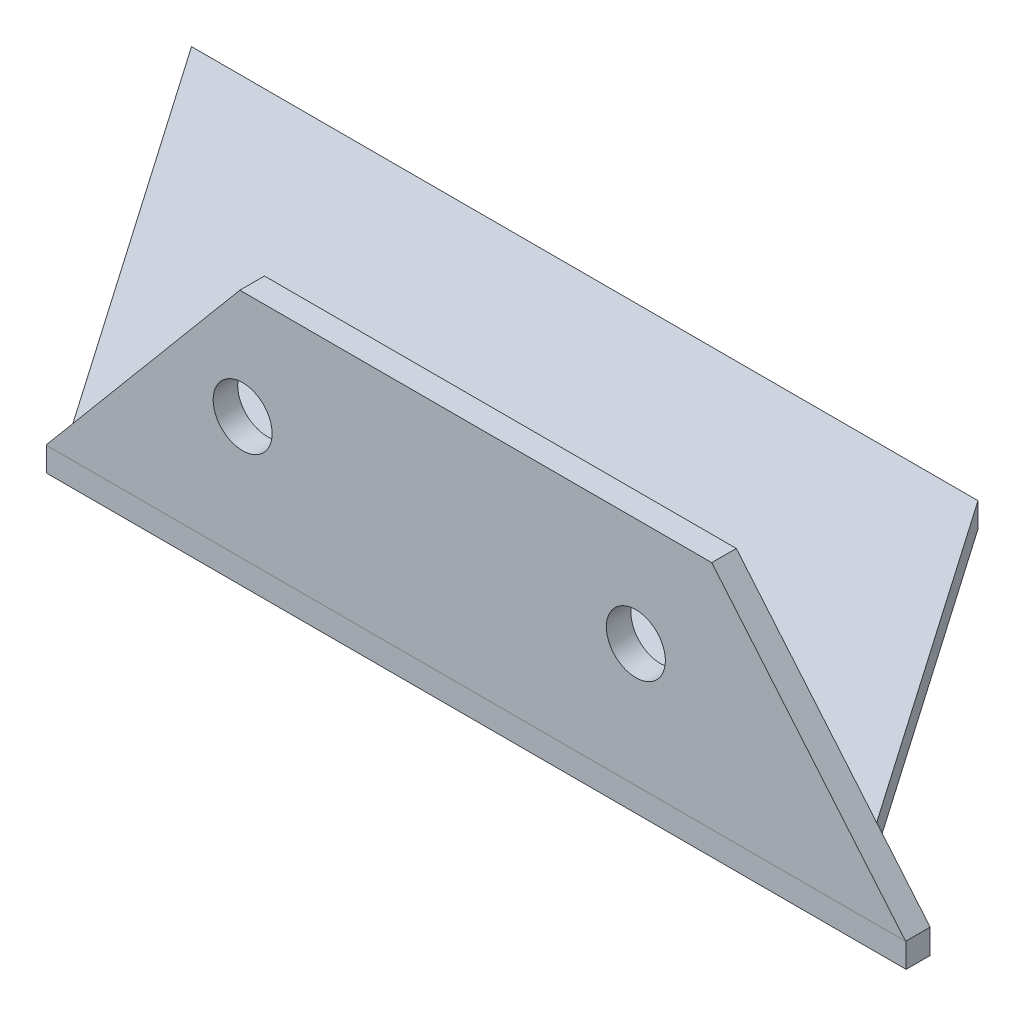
ISO-10303-21;
HEADER;
FILE_DESCRIPTION(('STEP AP214'),'2;1');
FILE_NAME('part.step','',(''),(''),'','','');
FILE_SCHEMA(('AUTOMOTIVE_DESIGN { 1 0 10303 214 1 1 1 1 }'));
ENDSEC;
DATA;
#1=APPLICATION_CONTEXT('core data for automotive mechanical design processes');
#2=APPLICATION_PROTOCOL_DEFINITION('international standard','automotive_design',2000,#1);
#3=PRODUCT_CONTEXT('',#1,'mechanical');
#4=PRODUCT('Part','Part','',(#3));
#5=PRODUCT_RELATED_PRODUCT_CATEGORY('part','',(#4));
#6=PRODUCT_DEFINITION_FORMATION('','',#4);
#7=PRODUCT_DEFINITION_CONTEXT('part definition',#1,'design');
#8=PRODUCT_DEFINITION('design','',#6,#7);
#9=PRODUCT_DEFINITION_SHAPE('','',#8);
#10=(LENGTH_UNIT() NAMED_UNIT(*) SI_UNIT(.MILLI.,.METRE.));
#11=(NAMED_UNIT(*) PLANE_ANGLE_UNIT() SI_UNIT($,.RADIAN.));
#12=(NAMED_UNIT(*) SI_UNIT($,.STERADIAN.) SOLID_ANGLE_UNIT());
#13=UNCERTAINTY_MEASURE_WITH_UNIT(LENGTH_MEASURE(1.E-05),#10,'distance_accuracy_value','');
#14=(GEOMETRIC_REPRESENTATION_CONTEXT(3) GLOBAL_UNCERTAINTY_ASSIGNED_CONTEXT((#13)) GLOBAL_UNIT_ASSIGNED_CONTEXT((#10,
#11,#12)) REPRESENTATION_CONTEXT('',''));
#15=CARTESIAN_POINT('',(0.,0.,0.));
#16=DIRECTION('',(0.,0.,1.));
#17=DIRECTION('',(1.,0.,0.));
#18=AXIS2_PLACEMENT_3D('',#15,#16,#17);
#19=CARTESIAN_POINT('',(0.,0.,-50.8));
#20=DIRECTION('',(0.,0.,-1.));
#21=DIRECTION('',(-1.,0.,0.));
#22=AXIS2_PLACEMENT_3D('',#19,#20,#21);
#23=PLANE('',#22);
#24=CARTESIAN_POINT('',(68.0262612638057,19.05,-50.8));
#25=DIRECTION('',(0.,0.,-1.));
#26=DIRECTION('',(-1.,0.,0.));
#27=AXIS2_PLACEMENT_3D('',#24,#25,#26);
#28=CIRCLE('',#27,3.81);
#29=CARTESIAN_POINT('',(64.2162612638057,19.05,-50.8));
#30=VERTEX_POINT('',#29);
#31=EDGE_CURVE('E148',#30,#30,#28,.T.);
#32=ORIENTED_EDGE('',*,*,#31,.T.);
#33=EDGE_LOOP('',(#32));
#34=FACE_BOUND('',#33,.T.);
#35=CARTESIAN_POINT('',(118.826261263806,19.05,-50.8));
#36=DIRECTION('',(0.,0.,-1.));
#37=DIRECTION('',(-1.,0.,0.));
#38=AXIS2_PLACEMENT_3D('',#35,#36,#37);
#39=CIRCLE('',#38,3.81);
#40=CARTESIAN_POINT('',(115.016261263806,19.05,-50.8));
#41=VERTEX_POINT('',#40);
#42=EDGE_CURVE('E126',#41,#41,#39,.T.);
#43=ORIENTED_EDGE('',*,*,#42,.T.);
#44=EDGE_LOOP('',(#43));
#45=FACE_BOUND('',#44,.T.);
#46=DIRECTION('',(-1.,0.,0.));
#47=VECTOR('',#46,1.);
#48=CARTESIAN_POINT('',(42.6262612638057,3.175,-50.8));
#49=LINE('',#48,#47);
#50=CARTESIAN_POINT('',(153.672118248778,3.175,-50.8));
#51=VERTEX_POINT('',#50);
#52=CARTESIAN_POINT('',(42.6262612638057,3.175,-50.8));
#53=VERTEX_POINT('',#52);
#54=EDGE_CURVE('E41',#51,#53,#49,.T.);
#55=ORIENTED_EDGE('',*,*,#54,.F.);
#56=DIRECTION('',(0.642787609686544,-0.766044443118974,0.));
#57=VECTOR('',#56,1.);
#58=CARTESIAN_POINT('',(128.629189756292,33.02,-50.8));
#59=LINE('',#58,#57);
#60=CARTESIAN_POINT('',(128.629189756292,33.02,-50.8));
#61=VERTEX_POINT('',#60);
#62=EDGE_CURVE('E153',#61,#51,#59,.T.);
#63=ORIENTED_EDGE('',*,*,#62,.F.);
#64=DIRECTION('',(1.,0.,0.));
#65=VECTOR('',#64,1.);
#66=CARTESIAN_POINT('',(67.6691897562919,33.02,-50.8));
#67=LINE('',#66,#65);
#68=CARTESIAN_POINT('',(67.6691897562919,33.02,-50.8));
#69=VERTEX_POINT('',#68);
#70=EDGE_CURVE('E73',#69,#61,#67,.T.);
#71=ORIENTED_EDGE('',*,*,#70,.F.);
#72=DIRECTION('',(0.642787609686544,0.766044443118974,0.));
#73=VECTOR('',#72,1.);
#74=CARTESIAN_POINT('',(42.6262612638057,3.175,-50.8));
#75=LINE('',#74,#73);
#76=EDGE_CURVE('E122',#53,#69,#75,.T.);
#77=ORIENTED_EDGE('',*,*,#76,.F.);
#78=EDGE_LOOP('',(#55,#63,#71,#77));
#79=FACE_BOUND('',#78,.T.);
#80=ADVANCED_FACE('F33',(#34,#45,#79),#23,.F.);
#81=CARTESIAN_POINT('',(0.,0.,0.));
#82=DIRECTION('',(0.,-1.,0.));
#83=DIRECTION('',(0.,0.,-1.));
#84=AXIS2_PLACEMENT_3D('',#81,#82,#83);
#85=PLANE('',#84);
#86=DIRECTION('',(1.,0.,0.));
#87=VECTOR('',#86,1.);
#88=CARTESIAN_POINT('',(0.,0.,-50.867683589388));
#89=LINE('',#88,#87);
#90=CARTESIAN_POINT('',(42.6262612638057,0.,-50.867683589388));
#91=VERTEX_POINT('',#90);
#92=CARTESIAN_POINT('',(153.672118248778,0.,-50.867683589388));
#93=VERTEX_POINT('',#92);
#94=EDGE_CURVE('E179',#91,#93,#89,.T.);
#95=ORIENTED_EDGE('',*,*,#94,.F.);
#96=DIRECTION('',(0.,0.,1.));
#97=VECTOR('',#96,1.);
#98=CARTESIAN_POINT('',(42.6262612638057,0.,-53.975));
#99=LINE('',#98,#97);
#100=CARTESIAN_POINT('',(42.6262612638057,0.,-53.975));
#101=VERTEX_POINT('',#100);
#102=EDGE_CURVE('E57',#101,#91,#99,.T.);
#103=ORIENTED_EDGE('',*,*,#102,.F.);
#104=DIRECTION('',(0.569279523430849,0.,0.822144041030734));
#105=VECTOR('',#104,1.);
#106=CARTESIAN_POINT('',(42.6262612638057,0.,-53.975));
#107=LINE('',#106,#105);
#108=CARTESIAN_POINT('',(7.4506735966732,0.,-104.775));
#109=VERTEX_POINT('',#108);
#110=EDGE_CURVE('E210',#109,#101,#107,.T.);
#111=ORIENTED_EDGE('',*,*,#110,.F.);
#112=DIRECTION('',(-1.,0.,0.));
#113=VECTOR('',#112,1.);
#114=CARTESIAN_POINT('',(109.050673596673,0.,-104.775));
#115=LINE('',#114,#113);
#116=CARTESIAN_POINT('',(109.050673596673,0.,-104.775));
#117=VERTEX_POINT('',#116);
#118=EDGE_CURVE('E131',#117,#109,#115,.T.);
#119=ORIENTED_EDGE('',*,*,#118,.F.);
#120=DIRECTION('',(-0.569279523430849,0.,-0.822144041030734));
#121=VECTOR('',#120,1.);
#122=CARTESIAN_POINT('',(144.226261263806,0.,-53.9750000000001));
#123=LINE('',#122,#121);
#124=CARTESIAN_POINT('',(144.226261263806,0.,-53.975));
#125=VERTEX_POINT('',#124);
#126=EDGE_CURVE('E128',#125,#117,#123,.T.);
#127=ORIENTED_EDGE('',*,*,#126,.F.);
#128=DIRECTION('',(-1.,0.,0.));
#129=VECTOR('',#128,1.);
#130=CARTESIAN_POINT('',(153.672118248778,0.,-53.975));
#131=LINE('',#130,#129);
#132=CARTESIAN_POINT('',(153.672118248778,0.,-53.975));
#133=VERTEX_POINT('',#132);
#134=EDGE_CURVE('E48',#133,#125,#131,.T.);
#135=ORIENTED_EDGE('',*,*,#134,.F.);
#136=DIRECTION('',(0.,0.,1.));
#137=VECTOR('',#136,1.);
#138=CARTESIAN_POINT('',(153.672118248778,0.,-53.975));
#139=LINE('',#138,#137);
#140=EDGE_CURVE('E112',#133,#93,#139,.T.);
#141=ORIENTED_EDGE('',*,*,#140,.T.);
#142=EDGE_LOOP('',(#95,#103,#111,#119,#127,#135,#141));
#143=FACE_BOUND('',#142,.T.);
#144=ADVANCED_FACE('F35',(#143),#85,.T.);
#145=CARTESIAN_POINT('',(42.6262612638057,0.,-53.975));
#146=DIRECTION('',(1.,0.,0.));
#147=DIRECTION('',(0.,0.,-1.));
#148=AXIS2_PLACEMENT_3D('',#145,#146,#147);
#149=PLANE('',#148);
#150=ORIENTED_EDGE('',*,*,#102,.T.);
#151=DIRECTION('',(0.,1.,0.));
#152=VECTOR('',#151,1.);
#153=CARTESIAN_POINT('',(42.6262612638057,0.,-50.867683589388));
#154=LINE('',#153,#152);
#155=CARTESIAN_POINT('',(42.6262612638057,3.175,-50.867683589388));
#156=VERTEX_POINT('',#155);
#157=EDGE_CURVE('E132',#91,#156,#154,.T.);
#158=ORIENTED_EDGE('',*,*,#157,.T.);
#159=DIRECTION('',(0.,0.,1.));
#160=VECTOR('',#159,1.);
#161=CARTESIAN_POINT('',(42.6262612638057,3.175,-53.975));
#162=LINE('',#161,#160);
#163=CARTESIAN_POINT('',(42.6262612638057,3.175,-53.975));
#164=VERTEX_POINT('',#163);
#165=EDGE_CURVE('E162',#164,#156,#162,.T.);
#166=ORIENTED_EDGE('',*,*,#165,.F.);
#167=DIRECTION('',(0.,1.,0.));
#168=VECTOR('',#167,1.);
#169=CARTESIAN_POINT('',(42.6262612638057,0.,-53.975));
#170=LINE('',#169,#168);
#171=EDGE_CURVE('E149',#101,#164,#170,.T.);
#172=ORIENTED_EDGE('',*,*,#171,.F.);
#173=EDGE_LOOP('',(#150,#158,#166,#172));
#174=FACE_BOUND('',#173,.T.);
#175=ADVANCED_FACE('F240',(#174),#149,.F.);
#176=CARTESIAN_POINT('',(42.6262612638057,3.175,-53.975));
#177=DIRECTION('',(0.766044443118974,-0.642787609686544,0.));
#178=DIRECTION('',(0.642787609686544,0.766044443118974,0.));
#179=AXIS2_PLACEMENT_3D('',#176,#177,#178);
#180=PLANE('',#179);
#181=ORIENTED_EDGE('',*,*,#76,.T.);
#182=DIRECTION('',(0.,0.,1.));
#183=VECTOR('',#182,1.);
#184=CARTESIAN_POINT('',(67.6691897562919,33.02,-53.975));
#185=LINE('',#184,#183);
#186=CARTESIAN_POINT('',(67.6691897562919,33.02,-53.975));
#187=VERTEX_POINT('',#186);
#188=EDGE_CURVE('E158',#187,#69,#185,.T.);
#189=ORIENTED_EDGE('',*,*,#188,.F.);
#190=DIRECTION('',(0.642787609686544,0.766044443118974,0.));
#191=VECTOR('',#190,1.);
#192=CARTESIAN_POINT('',(42.6262612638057,3.175,-53.975));
#193=LINE('',#192,#191);
#194=EDGE_CURVE('E152',#164,#187,#193,.T.);
#195=ORIENTED_EDGE('',*,*,#194,.F.);
#196=ORIENTED_EDGE('',*,*,#165,.T.);
#197=DIRECTION('',(0.,0.,-1.));
#198=VECTOR('',#197,1.);
#199=CARTESIAN_POINT('',(42.6262612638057,3.175,-53.975));
#200=LINE('',#199,#198);
#201=EDGE_CURVE('E228',#53,#156,#200,.T.);
#202=ORIENTED_EDGE('',*,*,#201,.F.);
#203=EDGE_LOOP('',(#181,#189,#195,#196,#202));
#204=FACE_BOUND('',#203,.T.);
#205=ADVANCED_FACE('F159',(#204),#180,.F.);
#206=CARTESIAN_POINT('',(67.6691897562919,33.02,-53.975));
#207=DIRECTION('',(0.,-1.,0.));
#208=DIRECTION('',(1.,0.,0.));
#209=AXIS2_PLACEMENT_3D('',#206,#207,#208);
#210=PLANE('',#209);
#211=ORIENTED_EDGE('',*,*,#70,.T.);
#212=DIRECTION('',(0.,0.,1.));
#213=VECTOR('',#212,1.);
#214=CARTESIAN_POINT('',(128.629189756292,33.02,-53.975));
#215=LINE('',#214,#213);
#216=CARTESIAN_POINT('',(128.629189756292,33.02,-53.975));
#217=VERTEX_POINT('',#216);
#218=EDGE_CURVE('E111',#217,#61,#215,.T.);
#219=ORIENTED_EDGE('',*,*,#218,.F.);
#220=DIRECTION('',(1.,0.,0.));
#221=VECTOR('',#220,1.);
#222=CARTESIAN_POINT('',(67.6691897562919,33.02,-53.975));
#223=LINE('',#222,#221);
#224=EDGE_CURVE('E99',#187,#217,#223,.T.);
#225=ORIENTED_EDGE('',*,*,#224,.F.);
#226=ORIENTED_EDGE('',*,*,#188,.T.);
#227=EDGE_LOOP('',(#211,#219,#225,#226));
#228=FACE_BOUND('',#227,.T.);
#229=ADVANCED_FACE('F164',(#228),#210,.F.);
#230=CARTESIAN_POINT('',(128.629189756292,33.02,-53.975));
#231=DIRECTION('',(-0.766044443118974,-0.642787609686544,0.));
#232=DIRECTION('',(0.642787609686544,-0.766044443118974,0.));
#233=AXIS2_PLACEMENT_3D('',#230,#231,#232);
#234=PLANE('',#233);
#235=ORIENTED_EDGE('',*,*,#62,.T.);
#236=DIRECTION('',(0.,0.,1.));
#237=VECTOR('',#236,1.);
#238=CARTESIAN_POINT('',(153.672118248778,3.175,-53.975));
#239=LINE('',#238,#237);
#240=CARTESIAN_POINT('',(153.672118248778,3.175,-50.867683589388));
#241=VERTEX_POINT('',#240);
#242=EDGE_CURVE('E109',#241,#51,#239,.T.);
#243=ORIENTED_EDGE('',*,*,#242,.F.);
#244=DIRECTION('',(0.,0.,1.));
#245=VECTOR('',#244,1.);
#246=CARTESIAN_POINT('',(153.672118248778,3.175,-53.975));
#247=LINE('',#246,#245);
#248=CARTESIAN_POINT('',(153.672118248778,3.175,-53.975));
#249=VERTEX_POINT('',#248);
#250=EDGE_CURVE('E104',#249,#241,#247,.T.);
#251=ORIENTED_EDGE('',*,*,#250,.F.);
#252=DIRECTION('',(0.642787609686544,-0.766044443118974,0.));
#253=VECTOR('',#252,1.);
#254=CARTESIAN_POINT('',(128.629189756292,33.02,-53.975));
#255=LINE('',#254,#253);
#256=EDGE_CURVE('E91',#217,#249,#255,.T.);
#257=ORIENTED_EDGE('',*,*,#256,.F.);
#258=ORIENTED_EDGE('',*,*,#218,.T.);
#259=EDGE_LOOP('',(#235,#243,#251,#257,#258));
#260=FACE_BOUND('',#259,.T.);
#261=ADVANCED_FACE('F106',(#260),#234,.F.);
#262=CARTESIAN_POINT('',(153.672118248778,3.175,-53.975));
#263=DIRECTION('',(-1.,0.,0.));
#264=DIRECTION('',(0.,0.,1.));
#265=AXIS2_PLACEMENT_3D('',#262,#263,#264);
#266=PLANE('',#265);
#267=ORIENTED_EDGE('',*,*,#250,.T.);
#268=DIRECTION('',(0.,-1.,0.));
#269=VECTOR('',#268,1.);
#270=CARTESIAN_POINT('',(153.672118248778,3.175,-50.867683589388));
#271=LINE('',#270,#269);
#272=EDGE_CURVE('E11',#241,#93,#271,.T.);
#273=ORIENTED_EDGE('',*,*,#272,.T.);
#274=ORIENTED_EDGE('',*,*,#140,.F.);
#275=DIRECTION('',(0.,-1.,0.));
#276=VECTOR('',#275,1.);
#277=CARTESIAN_POINT('',(153.672118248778,3.175,-53.975));
#278=LINE('',#277,#276);
#279=EDGE_CURVE('E96',#249,#133,#278,.T.);
#280=ORIENTED_EDGE('',*,*,#279,.F.);
#281=EDGE_LOOP('',(#267,#273,#274,#280));
#282=FACE_BOUND('',#281,.T.);
#283=ADVANCED_FACE('F114',(#282),#266,.F.);
#284=CARTESIAN_POINT('',(0.,0.,-53.975));
#285=DIRECTION('',(0.,0.,-1.));
#286=DIRECTION('',(-1.,0.,0.));
#287=AXIS2_PLACEMENT_3D('',#284,#285,#286);
#288=PLANE('',#287);
#289=DIRECTION('',(0.,-1.,0.));
#290=VECTOR('',#289,1.);
#291=CARTESIAN_POINT('',(144.226261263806,3.175,-53.9750000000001));
#292=LINE('',#291,#290);
#293=CARTESIAN_POINT('',(144.226261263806,3.175,-53.9750000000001));
#294=VERTEX_POINT('',#293);
#295=EDGE_CURVE('E134',#294,#125,#292,.T.);
#296=ORIENTED_EDGE('',*,*,#295,.F.);
#297=DIRECTION('',(1.,0.,0.));
#298=VECTOR('',#297,1.);
#299=CARTESIAN_POINT('',(42.6262612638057,3.175,-53.975));
#300=LINE('',#299,#298);
#301=EDGE_CURVE('E80',#164,#294,#300,.T.);
#302=ORIENTED_EDGE('',*,*,#301,.F.);
#303=ORIENTED_EDGE('',*,*,#194,.T.);
#304=ORIENTED_EDGE('',*,*,#224,.T.);
#305=ORIENTED_EDGE('',*,*,#256,.T.);
#306=ORIENTED_EDGE('',*,*,#279,.T.);
#307=ORIENTED_EDGE('',*,*,#134,.T.);
#308=EDGE_LOOP('',(#296,#302,#303,#304,#305,#306,#307));
#309=FACE_BOUND('',#308,.T.);
#310=CARTESIAN_POINT('',(118.826261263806,19.05,-53.975));
#311=DIRECTION('',(0.,0.,-1.));
#312=DIRECTION('',(-1.,0.,0.));
#313=AXIS2_PLACEMENT_3D('',#310,#311,#312);
#314=CIRCLE('',#313,3.81);
#315=CARTESIAN_POINT('',(115.016261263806,19.05,-53.975));
#316=VERTEX_POINT('',#315);
#317=EDGE_CURVE('E137',#316,#316,#314,.T.);
#318=ORIENTED_EDGE('',*,*,#317,.F.);
#319=EDGE_LOOP('',(#318));
#320=FACE_BOUND('',#319,.T.);
#321=CARTESIAN_POINT('',(68.0262612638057,19.05,-53.975));
#322=DIRECTION('',(0.,0.,-1.));
#323=DIRECTION('',(-1.,0.,0.));
#324=AXIS2_PLACEMENT_3D('',#321,#322,#323);
#325=CIRCLE('',#324,3.81);
#326=CARTESIAN_POINT('',(64.2162612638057,19.05,-53.975));
#327=VERTEX_POINT('',#326);
#328=EDGE_CURVE('E145',#327,#327,#325,.T.);
#329=ORIENTED_EDGE('',*,*,#328,.F.);
#330=EDGE_LOOP('',(#329));
#331=FACE_BOUND('',#330,.T.);
#332=ADVANCED_FACE('F93',(#309,#320,#331),#288,.T.);
#333=CARTESIAN_POINT('',(68.0262612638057,19.05,2.50000000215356E-05));
#334=DIRECTION('',(0.,0.,-1.));
#335=DIRECTION('',(-1.,0.,0.));
#336=AXIS2_PLACEMENT_3D('',#333,#334,#335);
#337=CYLINDRICAL_SURFACE('',#336,3.81);
#338=ORIENTED_EDGE('',*,*,#328,.T.);
#339=EDGE_LOOP('',(#338));
#340=FACE_BOUND('',#339,.T.);
#341=ORIENTED_EDGE('',*,*,#31,.F.);
#342=EDGE_LOOP('',(#341));
#343=FACE_BOUND('',#342,.T.);
#344=ADVANCED_FACE('F295',(#340,#343),#337,.F.);
#345=CARTESIAN_POINT('',(118.826261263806,19.05,2.50000000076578E-05));
#346=DIRECTION('',(0.,0.,-1.));
#347=DIRECTION('',(-1.,0.,0.));
#348=AXIS2_PLACEMENT_3D('',#345,#346,#347);
#349=CYLINDRICAL_SURFACE('',#348,3.81);
#350=ORIENTED_EDGE('',*,*,#317,.T.);
#351=EDGE_LOOP('',(#350));
#352=FACE_BOUND('',#351,.T.);
#353=ORIENTED_EDGE('',*,*,#42,.F.);
#354=EDGE_LOOP('',(#353));
#355=FACE_BOUND('',#354,.T.);
#356=ADVANCED_FACE('F302',(#352,#355),#349,.F.);
#357=CARTESIAN_POINT('',(144.226261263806,3.175,-53.9750000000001));
#358=DIRECTION('',(-0.822144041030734,0.,0.569279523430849));
#359=DIRECTION('',(0.569279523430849,0.,0.822144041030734));
#360=AXIS2_PLACEMENT_3D('',#357,#358,#359);
#361=PLANE('',#360);
#362=ORIENTED_EDGE('',*,*,#126,.T.);
#363=DIRECTION('',(0.,-1.,0.));
#364=VECTOR('',#363,1.);
#365=CARTESIAN_POINT('',(109.050673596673,3.175,-104.775));
#366=LINE('',#365,#364);
#367=CARTESIAN_POINT('',(109.050673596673,3.175,-104.775));
#368=VERTEX_POINT('',#367);
#369=EDGE_CURVE('E138',#368,#117,#366,.T.);
#370=ORIENTED_EDGE('',*,*,#369,.F.);
#371=DIRECTION('',(-0.569279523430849,0.,-0.822144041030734));
#372=VECTOR('',#371,1.);
#373=CARTESIAN_POINT('',(144.226261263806,3.175,-53.9750000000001));
#374=LINE('',#373,#372);
#375=EDGE_CURVE('E218',#294,#368,#374,.T.);
#376=ORIENTED_EDGE('',*,*,#375,.F.);
#377=ORIENTED_EDGE('',*,*,#295,.T.);
#378=EDGE_LOOP('',(#362,#370,#376,#377));
#379=FACE_BOUND('',#378,.T.);
#380=ADVANCED_FACE('F308',(#379),#361,.F.);
#381=CARTESIAN_POINT('',(109.050673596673,3.175,-104.775));
#382=DIRECTION('',(0.,0.,1.));
#383=DIRECTION('',(1.,0.,0.));
#384=AXIS2_PLACEMENT_3D('',#381,#382,#383);
#385=PLANE('',#384);
#386=ORIENTED_EDGE('',*,*,#118,.T.);
#387=DIRECTION('',(0.,-1.,0.));
#388=VECTOR('',#387,1.);
#389=CARTESIAN_POINT('',(7.4506735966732,3.175,-104.775));
#390=LINE('',#389,#388);
#391=CARTESIAN_POINT('',(7.4506735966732,3.175,-104.775));
#392=VERTEX_POINT('',#391);
#393=EDGE_CURVE('E208',#392,#109,#390,.T.);
#394=ORIENTED_EDGE('',*,*,#393,.F.);
#395=DIRECTION('',(-1.,0.,0.));
#396=VECTOR('',#395,1.);
#397=CARTESIAN_POINT('',(109.050673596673,3.175,-104.775));
#398=LINE('',#397,#396);
#399=EDGE_CURVE('E222',#368,#392,#398,.T.);
#400=ORIENTED_EDGE('',*,*,#399,.F.);
#401=ORIENTED_EDGE('',*,*,#369,.T.);
#402=EDGE_LOOP('',(#386,#394,#400,#401));
#403=FACE_BOUND('',#402,.T.);
#404=ADVANCED_FACE('F206',(#403),#385,.F.);
#405=CARTESIAN_POINT('',(42.6262612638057,3.175,-53.975));
#406=DIRECTION('',(0.822144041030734,0.,-0.569279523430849));
#407=DIRECTION('',(-0.569279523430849,0.,-0.822144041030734));
#408=AXIS2_PLACEMENT_3D('',#405,#406,#407);
#409=PLANE('',#408);
#410=ORIENTED_EDGE('',*,*,#110,.T.);
#411=ORIENTED_EDGE('',*,*,#171,.T.);
#412=DIRECTION('',(0.569279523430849,0.,0.822144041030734));
#413=VECTOR('',#412,1.);
#414=CARTESIAN_POINT('',(42.6262612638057,3.175,-53.975));
#415=LINE('',#414,#413);
#416=EDGE_CURVE('E216',#392,#164,#415,.T.);
#417=ORIENTED_EDGE('',*,*,#416,.F.);
#418=ORIENTED_EDGE('',*,*,#393,.T.);
#419=EDGE_LOOP('',(#410,#411,#417,#418));
#420=FACE_BOUND('',#419,.T.);
#421=ADVANCED_FACE('F214',(#420),#409,.F.);
#422=CARTESIAN_POINT('',(0.,3.175,0.));
#423=DIRECTION('',(0.,1.,0.));
#424=DIRECTION('',(0.,0.,1.));
#425=AXIS2_PLACEMENT_3D('',#422,#423,#424);
#426=PLANE('',#425);
#427=ORIENTED_EDGE('',*,*,#301,.T.);
#428=ORIENTED_EDGE('',*,*,#375,.T.);
#429=ORIENTED_EDGE('',*,*,#399,.T.);
#430=ORIENTED_EDGE('',*,*,#416,.T.);
#431=EDGE_LOOP('',(#427,#428,#429,#430));
#432=FACE_BOUND('',#431,.T.);
#433=ADVANCED_FACE('F248',(#432),#426,.T.);
#434=CARTESIAN_POINT('',(-6.10151360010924,-5.00000000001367E-05,-50.867683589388));
#435=DIRECTION('',(0.,0.,-1.));
#436=DIRECTION('',(-1.,0.,0.));
#437=AXIS2_PLACEMENT_3D('',#434,#435,#436);
#438=PLANE('',#437);
#439=ORIENTED_EDGE('',*,*,#94,.T.);
#440=ORIENTED_EDGE('',*,*,#272,.F.);
#441=DIRECTION('',(-1.,0.,0.));
#442=VECTOR('',#441,1.);
#443=CARTESIAN_POINT('',(-6.10151360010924,3.175,-50.867683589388));
#444=LINE('',#443,#442);
#445=EDGE_CURVE('E232',#241,#156,#444,.T.);
#446=ORIENTED_EDGE('',*,*,#445,.T.);
#447=ORIENTED_EDGE('',*,*,#157,.F.);
#448=EDGE_LOOP('',(#439,#440,#446,#447));
#449=FACE_BOUND('',#448,.T.);
#450=ADVANCED_FACE('F236',(#449),#438,.F.);
#451=CARTESIAN_POINT('',(0.,3.175,0.));
#452=DIRECTION('',(0.,-1.,0.));
#453=DIRECTION('',(0.,0.,-1.));
#454=AXIS2_PLACEMENT_3D('',#451,#452,#453);
#455=PLANE('',#454);
#456=ORIENTED_EDGE('',*,*,#201,.T.);
#457=ORIENTED_EDGE('',*,*,#445,.F.);
#458=ORIENTED_EDGE('',*,*,#242,.T.);
#459=ORIENTED_EDGE('',*,*,#54,.T.);
#460=EDGE_LOOP('',(#456,#457,#458,#459));
#461=FACE_BOUND('',#460,.T.);
#462=ADVANCED_FACE('F242',(#461),#455,.T.);
#463=CLOSED_SHELL('',(#80,#144,#175,#205,#229,#261,#283,#332,#344,#356,#380,#404,#421,#433,#450,#462));
#464=MANIFOLD_SOLID_BREP('B2',#463);
#465=ADVANCED_BREP_SHAPE_REPRESENTATION('',(#18,#464),#14);
#466=SHAPE_DEFINITION_REPRESENTATION(#9,#465);
ENDSEC;
END-ISO-10303-21;
